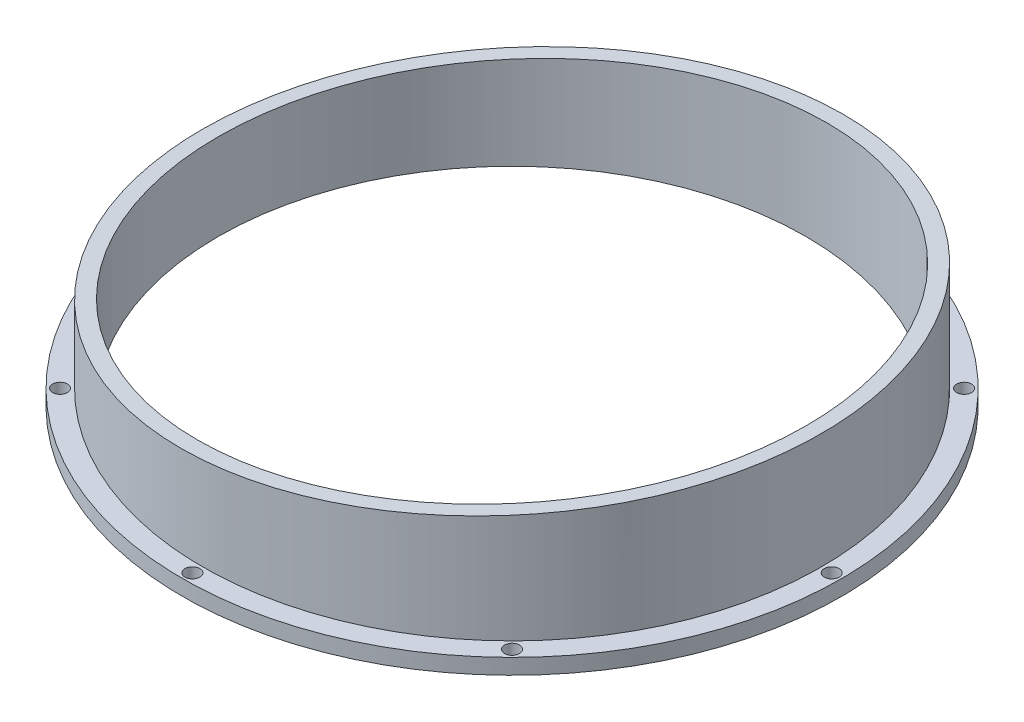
from build123d import *

# Parameters (mm, degrees)
SKETCH1_R                      = 50.673
EXTRUDE1_DEPTH                 = 25.4
SKETCH2_R                      = 53.975
EXTRUDE2_DEPTH                 = 2.54
SKETCH4_R                      = 48.133
EXTRUDE3_DEPTH                 = 82.284960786
EXTRUDE5_DEPTH                 = 81.447257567
EXTRUDE5_DEPTH_BACK            = 81.447257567
F_2_CLEARANCE_HOLE1_AT_2_COUNT = 2
F_2_CLEARANCE_HOLE1_AT_2_PITCH = 3.966957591
CIRPATTERN1_COUNT              = 8


with BuildPart() as part:
    # Sketch1 → Extrude1 (new body)
    with BuildSketch(Plane(origin=(0, 0, 0), x_dir=(1, 0, 0), z_dir=(0, 1, 0))):
        with Locations(Location((0, 0, 0), (0, 0, 270))):
            Circle(SKETCH1_R)
    extrude(amount=EXTRUDE1_DEPTH)

    # Sketch2 → Extrude2 (add)
    with BuildSketch(Plane.XZ):
        with Locations(Location((0, 0, 0), (0, 0, 270))):
            Circle(SKETCH2_R)
    extrude(amount=EXTRUDE2_DEPTH)

    # Sketch4 → Extrude3 (cut, through all)
    with BuildSketch(Plane(origin=(0, 25.4, 0), x_dir=(-1, 0, 0), z_dir=(0, 1, 0))):
        with Locations(Location((0, 0, 0), (0, 0, 90))):
            Circle(SKETCH4_R)
    extrude(amount=-EXTRUDE3_DEPTH, mode=Mode.SUBTRACT)

    # Sketch6 → Extrude5 (cut, two sides: drawn at the far end of the back side and taken through both)
    with BuildSketch(Plane.XY.offset(-EXTRUDE5_DEPTH_BACK)):
        Polygon((273.717521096, 35.422523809), (50.673, 18.925737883), (-50.673, 11.43), (-273.717521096, -5.066785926), (-306.711092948, 441.022256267), (240.723949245, 481.511566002), align=None)
    extrude(amount=EXTRUDE5_DEPTH + EXTRUDE5_DEPTH_BACK, mode=Mode.SUBTRACT)

    # Sketch8 → 2 Clearance Hole1 (revolve, cut)
    with BuildSketch(Plane(origin=(-52.3494, -2.54, 0), x_dir=(0, 0, -1), z_dir=(1, 0, 0))):
        Polygon((0, 0), (0, 9.876569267), (1.2192, 9.144), (1.2192, 0), align=None)
    f_2_clearance_hole1 = revolve(axis=Axis((-52.3494, -8.89, 0), (0, 1, 0)), mode=Mode.SUBTRACT)

    # 2 Clearance Hole1 at 2: 2 Clearance Hole1 ×2
    with Locations(*[(-i * F_2_CLEARANCE_HOLE1_AT_2_PITCH, 0, 0) for i in range(1, F_2_CLEARANCE_HOLE1_AT_2_COUNT)]):
        add(f_2_clearance_hole1, mode=Mode.SUBTRACT)

    # CirPattern1: 2 Clearance Hole1 ×8 about axis
    cirpattern1_axis = Axis((0, 0, 0), (0, 1, 0))
    for i in range(1, CIRPATTERN1_COUNT):
        add(f_2_clearance_hole1.rotate(cirpattern1_axis, i * 360 / CIRPATTERN1_COUNT), mode=Mode.SUBTRACT)

    # CirPattern1 copy 1 sketch → CirPattern1 copy 1 (revolve, cut)
    with BuildSketch(Plane(origin=(-39.821678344, -2.54, 39.821678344), x_dir=(-0.7071067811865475, 0, -0.7071067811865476), z_dir=(0.7071067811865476, 0, -0.7071067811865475))):
        Polygon((0, 0), (0, 9.876569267), (1.2192, 9.144), (1.2192, 0), align=None)
    revolve(axis=Axis((-39.821678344, -8.89, 39.821678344), (0, 1, 0)), mode=Mode.SUBTRACT)

    # CirPattern1 copy 2 sketch → CirPattern1 copy 2 (revolve, cut)
    with BuildSketch(Plane(origin=(0, -2.54, 56.316357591), x_dir=(-1, 0, 0), z_dir=(0, 0, -1))):
        Polygon((0, 0), (0, 9.876569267), (1.2192, 9.144), (1.2192, 0), align=None)
    revolve(axis=Axis((0, -8.89, 56.316357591), (0, 1, 0)), mode=Mode.SUBTRACT)

    # CirPattern1 copy 3 sketch → CirPattern1 copy 3 (revolve, cut)
    with BuildSketch(Plane(origin=(39.821678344, -2.54, 39.821678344), x_dir=(-0.7071067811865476, 0, 0.7071067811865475), z_dir=(-0.7071067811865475, 0, -0.7071067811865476))):
        Polygon((0, 0), (0, 9.876569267), (1.2192, 9.144), (1.2192, 0), align=None)
    revolve(axis=Axis((39.821678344, -8.89, 39.821678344), (0, 1, 0)), mode=Mode.SUBTRACT)

    # CirPattern1 copy 4 sketch → CirPattern1 copy 4 (revolve, cut)
    with BuildSketch(Plane(origin=(56.316357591, -2.54, 0), x_dir=(0, 0, 1), z_dir=(-1, 0, 0))):
        Polygon((0, 0), (0, 9.876569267), (1.2192, 9.144), (1.2192, 0), align=None)
    revolve(axis=Axis((56.316357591, -8.89, 0), (0, 1, 0)), mode=Mode.SUBTRACT)

    # CirPattern1 copy 5 sketch → CirPattern1 copy 5 (revolve, cut)
    with BuildSketch(Plane(origin=(39.821678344, -2.54, -39.821678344), x_dir=(0.7071067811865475, 0, 0.7071067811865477), z_dir=(-0.7071067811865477, 0, 0.7071067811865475))):
        Polygon((0, 0), (0, 9.876569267), (1.2192, 9.144), (1.2192, 0), align=None)
    revolve(axis=Axis((39.821678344, -8.89, -39.821678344), (0, 1, 0)), mode=Mode.SUBTRACT)

    # CirPattern1 copy 6 sketch → CirPattern1 copy 6 (revolve, cut)
    with BuildSketch(Plane(origin=(0, -2.54, -56.316357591), x_dir=(1, 0, 0), z_dir=(0, 0, 1))):
        Polygon((0, 0), (0, 9.876569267), (1.2192, 9.144), (1.2192, 0), align=None)
    revolve(axis=Axis((0, -8.89, -56.316357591), (0, 1, 0)), mode=Mode.SUBTRACT)

    # CirPattern1 copy 7 sketch → CirPattern1 copy 7 (revolve, cut)
    with BuildSketch(Plane(origin=(-39.821678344, -2.54, -39.821678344), x_dir=(0.7071067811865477, 0, -0.7071067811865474), z_dir=(0.7071067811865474, 0, 0.7071067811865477))):
        Polygon((0, 0), (0, 9.876569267), (1.2192, 9.144), (1.2192, 0), align=None)
    revolve(axis=Axis((-39.821678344, -8.89, -39.821678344), (0, 1, 0)), mode=Mode.SUBTRACT)


solid = part.part
